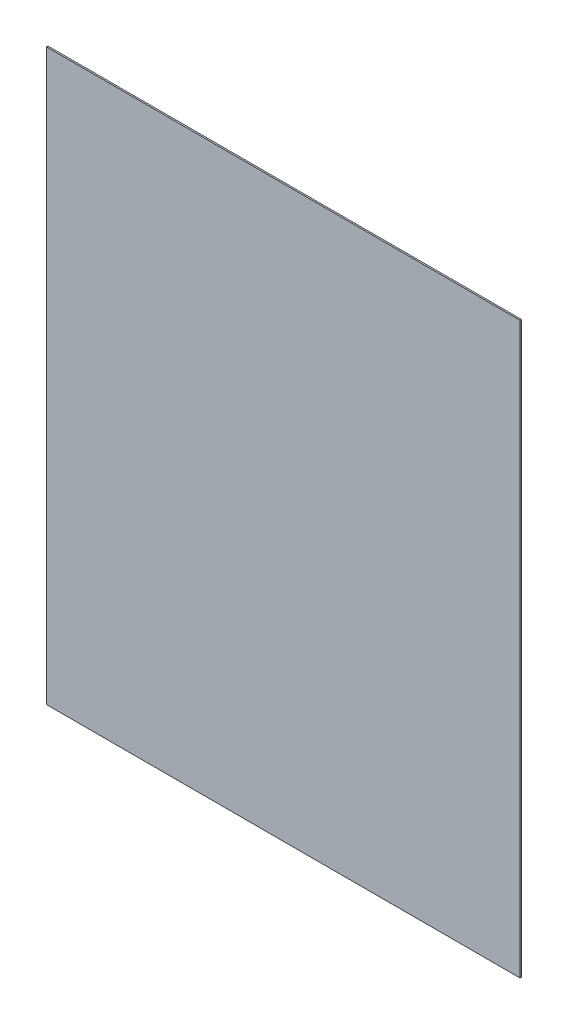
from build123d import *

# Parameters (mm, degrees)
MODEL_W                 = 158.99999996
MODEL_H                 = 189.999999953
BOSS_EXTRU_1_DEPTH      = 0.5
ESQUISSE1_W             = 13.525101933
ESQUISSE1_H             = 201.055842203
ENL_V_MAT_EXTRU_1_DEPTH = 1448.140010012


with BuildPart() as part:
    # Model → Boss.-Extru.1 (new body)
    with BuildSketch(Plane.XY):
        with Locations((1211.274691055, 559.304711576)):
            Rectangle(MODEL_W, MODEL_H)
    extrude(amount=BOSS_EXTRU_1_DEPTH)

    # Esquisse1 → Enl_v. mat.-Extru.1 (cut, through all)
    with BuildSketch(Plane.XY.offset(0.5)):
        with Locations((1126.012140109, 559.174662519)):
            Rectangle(ESQUISSE1_W, ESQUISSE1_H)
    extrude(amount=-ENL_V_MAT_EXTRU_1_DEPTH, mode=Mode.SUBTRACT)


solid = part.part
